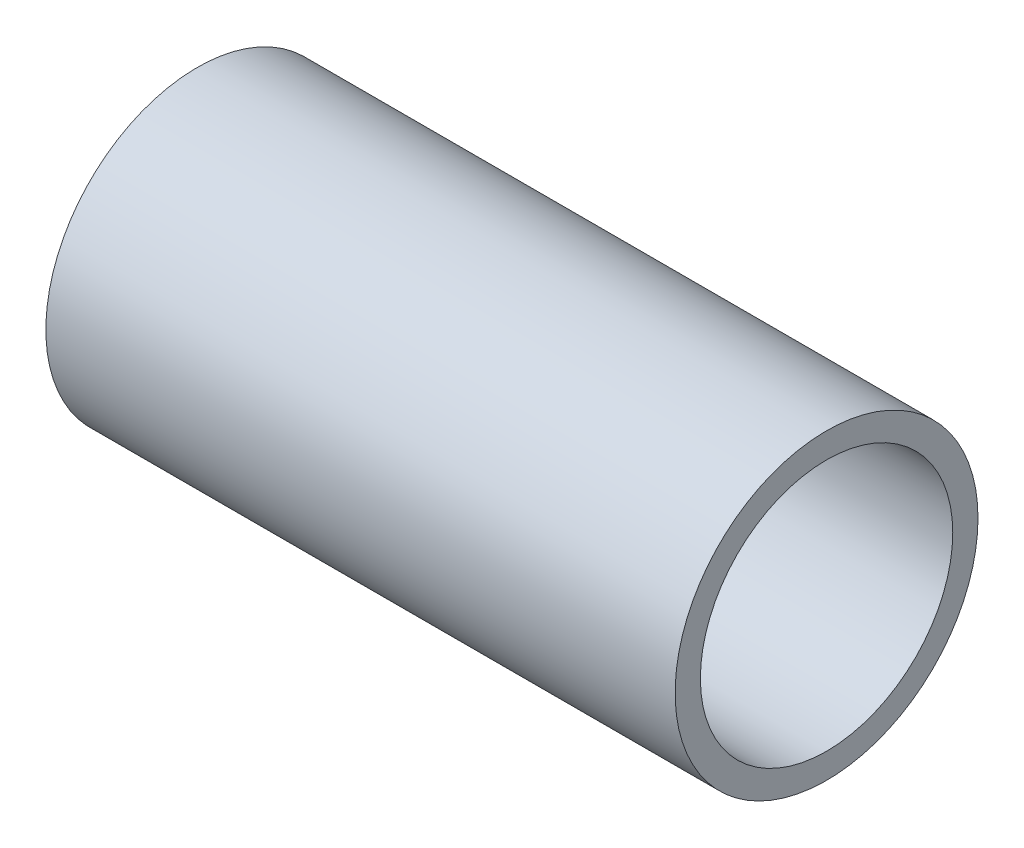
from build123d import *

# Parameters (mm, degrees)
SKIZZE1_W = 124.669627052
SKIZZE1_H = 5


with BuildPart() as part:
    # Skizze1 → Rotation1 (revolve)
    with BuildSketch(Plane.XY, mode=Mode.PRIVATE) as rotation1_sk:
        with Locations((0, 27.5)):
            Rectangle(SKIZZE1_W, SKIZZE1_H)
    revolve(rotation1_sk.sketch.rotate(Axis((0, 0, 0), (-1, 0, 0)), 90), axis=Axis((0, 0, 0), (-1, 0, 0)))


solid = part.part
